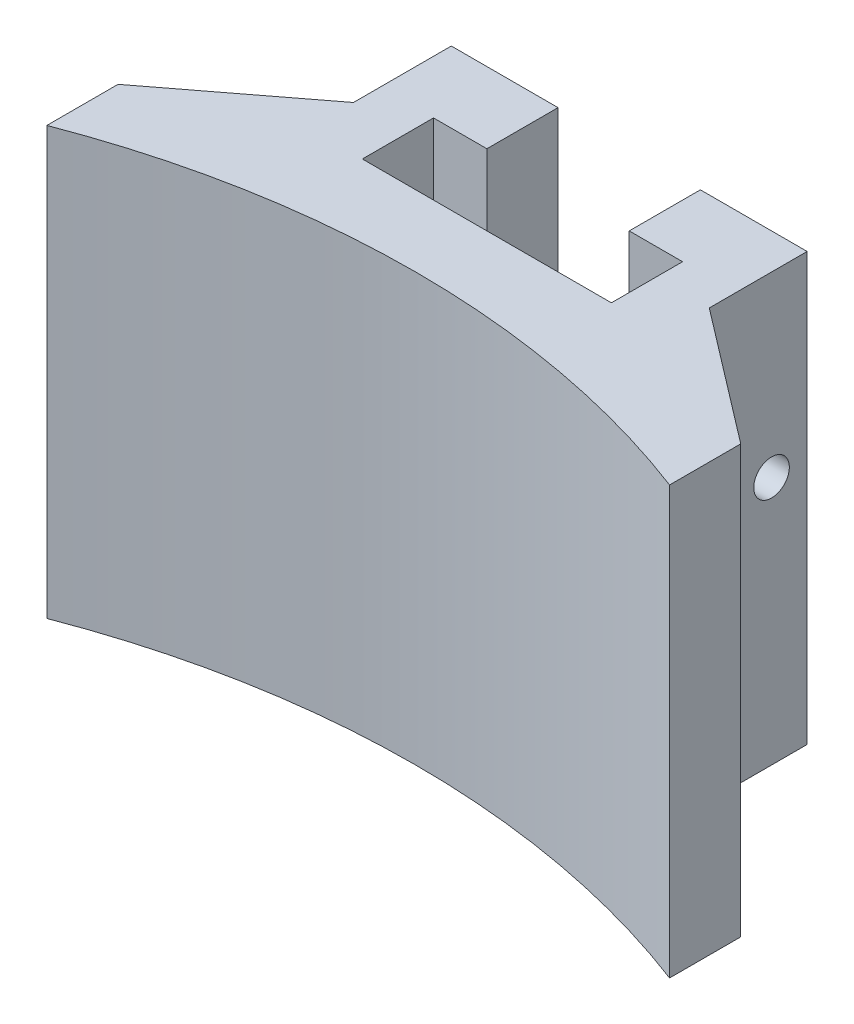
from build123d import *

# Parameters (mm, degrees)
SKETCH1_W           = 20
SKETCH1_H           = 24
BOSS_EXTRUDE1_DEPTH = 11
CUT_EXTRUDE1_DEPTH  = 20
SKETCH3_R           = 1
CUT_EXTRUDE2_DEPTH  = 26.787593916
BOSS_EXTRUDE2_DEPTH = 24


with BuildPart() as part:
    # Sketch1 → Boss-Extrude1 (new body)
    with BuildSketch(Plane.XY):
        Rectangle(SKETCH1_W, SKETCH1_H)
    extrude(amount=BOSS_EXTRUDE1_DEPTH)

    # Sketch2 → Cut-Extrude1 (cut)
    with BuildSketch(Plane(origin=(0, 12, 0), x_dir=(1, 0, 0), z_dir=(0, 1, 0))):
        Polygon((-4, 0), (4, 0), (4, -4), (7, -4), (7, -8), (-7, -8), (-7, -4), (-4, -4), align=None)
    extrude(amount=-CUT_EXTRUDE1_DEPTH, mode=Mode.SUBTRACT)

    # Sketch3 → Cut-Extrude2 (cut, through all)
    with BuildSketch(Plane.ZY.offset(10)):
        with Locations((2, 2)):
            Circle(SKETCH3_R)
    extrude(amount=-CUT_EXTRUDE2_DEPTH, mode=Mode.SUBTRACT)

    # Sketch4 → Boss-Extrude2 (add)
    with BuildSketch(Plane.XZ.offset(12)):
        with BuildLine():
            Line((17.5, 15.231561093), (17.5, 11.231561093))
            Line((17.5, 11.231561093), (10, 5.5))
            Line((10, 5.5), (10, 11))
            Line((10, 11), (-10, 11))
            Line((-10, 11), (-10, 5.5))
            Line((-10, 5.5), (-17.5, 11.231561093))
            Line((-17.5, 11.231561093), (-17.5, 15.231561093))
            ThreePointArc((-17.5, 15.231561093), (0, 12), (17.5, 15.231561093))
        make_face()
    extrude(amount=-BOSS_EXTRUDE2_DEPTH)


solid = part.part
